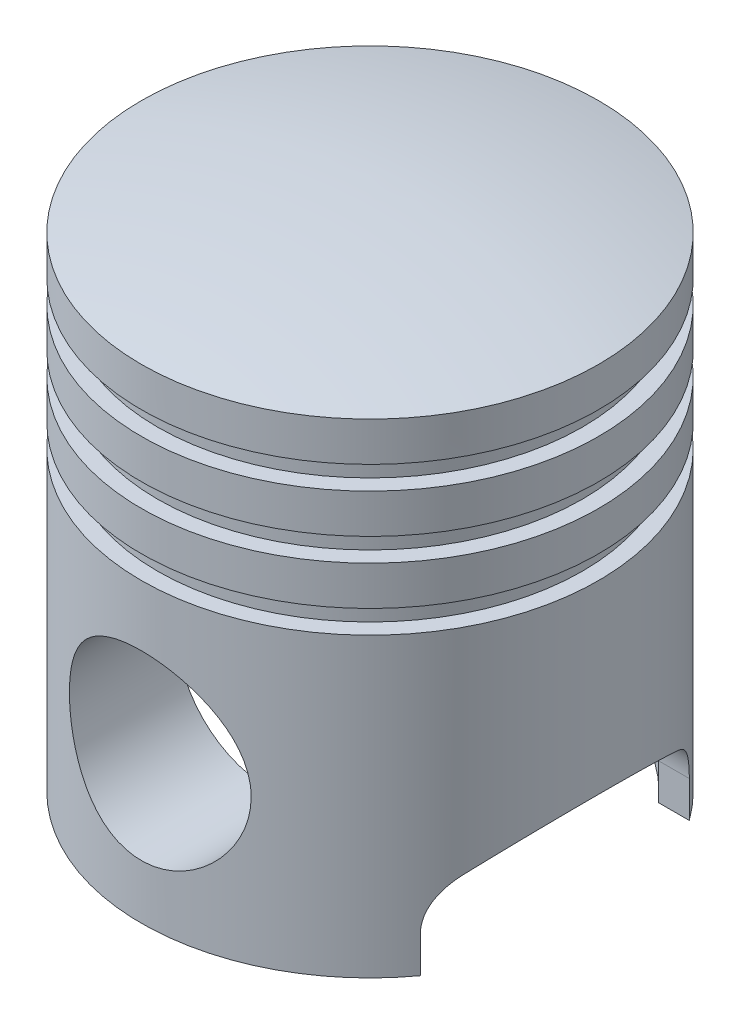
from build123d import *

# Parameters (mm, degrees)
SKETCH4_R                = 42.5
BOSS_EXTRUDE3_DEPTH      = 90
CUT_EXTRUDE1_START       = -7.3
SKETCH5_OUTSIDE_W        = 117.034
SKETCH5_OUTSIDE_H        = 117.034
SKETCH5_OUTSIDE_R        = 39.5
CUT_EXTRUDE1_DEPTH       = 4.3
LPATTERN1_COUNT          = 3
LPATTERN1_PITCH          = 11.6
CUT_EXTRUDE2_START       = -4
SKETCH6_R                = 38
CUT_EXTRUDE2_DEPTH       = 86
DOME1_FACE_RADIUS        = 42.5
DOME1_HEIGHT             = 5
CUT_EXTRUDE4_DEPTH       = 113.41663578
CUT_EXTRUDE4_DEPTH_BACK  = 113.41663578
SKETCH7_R                = 16.9
CUT_EXTRUDE5_DEPTH       = 113.416635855
CUT_EXTRUDE5_DEPTH_BACK  = 113.416635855
FILLET3_R                = 10
BOSS_EXTRUDE4_REACH      = 133.417
BOSS_EXTRUDE4_END_RADIUS = 38
BOSS_EXTRUDE4_START      = 19
SKETCH9_R                = 22.5
SKETCH9_R_2              = 16.9


with BuildPart() as part:
    # Sketch4 → Boss-Extrude3 (new body)
    with BuildSketch(Plane(origin=(0, 0, 0), x_dir=(1, 0, 0), z_dir=(0, 1, 0))):
        with Locations(Location((0, 0, 0), (0, 0, 90))):
            Circle(SKETCH4_R)
    extrude(amount=BOSS_EXTRUDE3_DEPTH)

    # Sketch5 outside → Cut-Extrude1 (cut)
    with BuildSketch(Plane(origin=(0, 90, 0), x_dir=(1, 0, 0), z_dir=(0, 1, 0)).offset(CUT_EXTRUDE1_START)):
        Rectangle(SKETCH5_OUTSIDE_W, SKETCH5_OUTSIDE_H)
        with Locations(Location((0, 0, 0), (0, 0, 270))):
            Circle(SKETCH5_OUTSIDE_R, mode=Mode.SUBTRACT)
    cut_extrude1 = extrude(amount=-CUT_EXTRUDE1_DEPTH, mode=Mode.SUBTRACT)

    # LPattern1: Cut-Extrude1 ×3
    with Locations(*[(0, -i * LPATTERN1_PITCH, 0) for i in range(1, LPATTERN1_COUNT)]):
        add(cut_extrude1, mode=Mode.SUBTRACT)

    # Sketch6 → Cut-Extrude2 (cut)
    with BuildSketch(Plane(origin=(0, 90, 0), x_dir=(1, 0, 0), z_dir=(0, 1, 0)).offset(CUT_EXTRUDE2_START)):
        with Locations(Location((0, 0, 0), (0, 0, 270))):
            Circle(SKETCH6_R)
    extrude(amount=-CUT_EXTRUDE2_DEPTH, mode=Mode.SUBTRACT)

    # Dome1: a dome of height H over a round flat face of radius A is a cap of a sphere of radius (A * A + H * H) / (2 * H)
    dome1_r = (DOME1_FACE_RADIUS * DOME1_FACE_RADIUS + DOME1_HEIGHT * DOME1_HEIGHT) / (2 * DOME1_HEIGHT)
    dome1_base = Plane((0, 90, 0), z_dir=(0, 1, 0))
    with Locations(dome1_base.offset(DOME1_HEIGHT - dome1_r)):
        dome1_ball = Sphere(dome1_r, mode=Mode.PRIVATE)
    add(split(dome1_ball, bisect_by=dome1_base, keep=Keep.TOP, mode=Mode.PRIVATE))

    # Sketch7 → Cut-Extrude4 (cut, two sides: drawn at the far end of the back side and taken through both)
    with BuildSketch(Plane.XY.offset(-CUT_EXTRUDE4_DEPTH_BACK)):
        with Locations((0, 27)):
            Circle(SKETCH7_R)
    extrude(amount=CUT_EXTRUDE4_DEPTH + CUT_EXTRUDE4_DEPTH_BACK, mode=Mode.SUBTRACT)

    # Sketch8 → Cut-Extrude5 (cut, two sides: drawn at the far end of the back side and taken through both)
    with BuildSketch(Plane(origin=(0, 0, 0), x_dir=(0, 0, -1), z_dir=(1, 0, 0)).offset(-CUT_EXTRUDE5_DEPTH_BACK)):
        with BuildLine():
            Line((-25, -243.077240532), (-25, 0))
            Line((-25, 0), (-25, 12))
            ThreePointArc((-25, 12), (0, 20.775010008), (25, 12))
            Line((25, 12), (25, 0))
            Line((25, 0), (25, -243.077240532))
            Line((25, -243.077240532), (25, -729.231721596))
            Line((25, -729.231721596), (-25, -729.231721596))
            Line((-25, -729.231721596), (-25, -243.077240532))
        make_face()
    extrude(amount=CUT_EXTRUDE5_DEPTH + CUT_EXTRUDE5_DEPTH_BACK, mode=Mode.SUBTRACT)

    # Fillet3
    fillet3_edges = [part.edges().sort_by_distance(p)[0] for p in [
        (-31.493746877, 12, -25),
        (31.493746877, 12, -25),
        (31.493746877, 12, 25),
        (-31.493746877, 12, 25),
    ]]
    fillet(fillet3_edges, radius=FILLET3_R)

    # Boss-Extrude4: up to this cylinder (the profile starts inside it)
    boss_extrude4_end = Plane(origin=(0, 5.136396, 0), z_dir=(0, 1, 0)) * Cylinder(BOSS_EXTRUDE4_END_RADIUS, 343.834, mode=Mode.PRIVATE)
    # Sketch9 → Boss-Extrude4 (add, up to the surface)
    with BuildSketch(Plane.XY.offset(BOSS_EXTRUDE4_START), mode=Mode.PRIVATE) as boss_extrude4_sk1:
        with Locations(Location((0, 27, 0), (0, 0, 90))):
            Circle(SKETCH9_R)
        with Locations((0, 27)):
            Circle(SKETCH9_R_2, mode=Mode.SUBTRACT)
    boss_extrude4_tool1 = extrude(boss_extrude4_sk1.sketch, amount=BOSS_EXTRUDE4_REACH, mode=Mode.PRIVATE) & boss_extrude4_end
    boss_extrude4 = boss_extrude4_tool1.solids().sort_by_distance((0, 5.136396, 19))[0]
    add(boss_extrude4)

    # Mirror1: Boss-Extrude4 across plane
    add(boss_extrude4.mirror(Plane.XY))


solid = part.part
